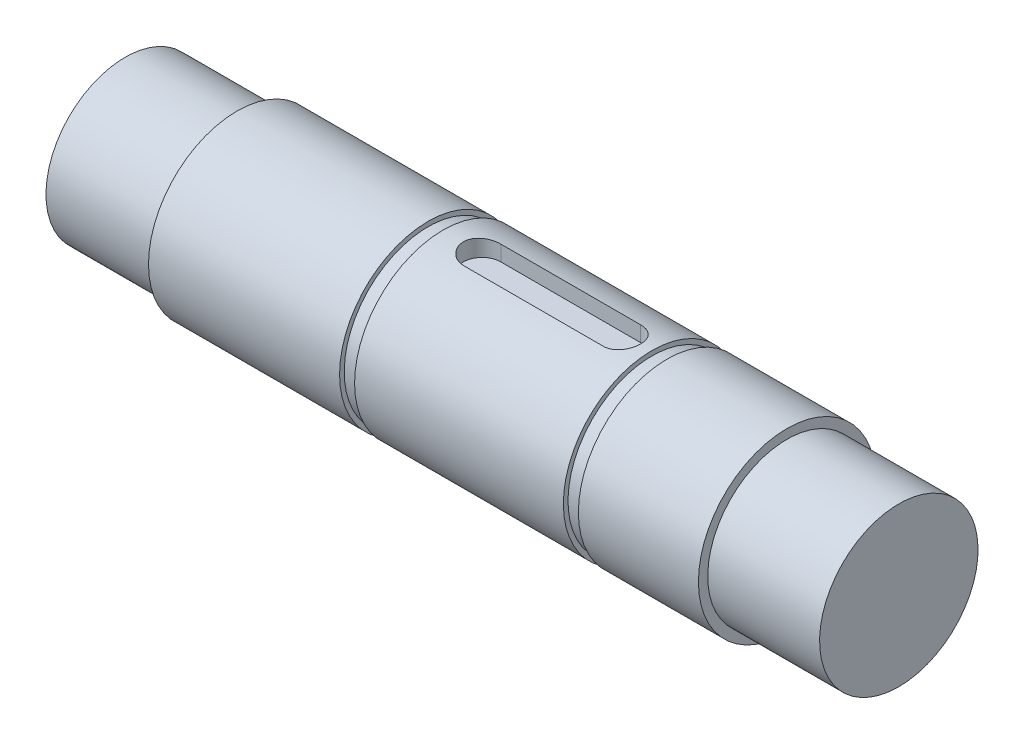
from build123d import *

# Parameters (mm, degrees)
SKETCH8_W          = 4
SKETCH8_H          = 1.9
CUT_EXTRUDE1_DEPTH = 7.5
CUT_EXTRUDE2_DEPTH = 10


with BuildPart() as part:
    # Sketch2 → Revolve2 (revolve)
    with BuildSketch(Plane.XY):
        Polygon((70.926736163, 9.411007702), (70.926736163, 0.911007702), (82.926736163, 0.911007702), (82.926736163, -0.088992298), (103.426736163, -0.088992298), (103.426736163, 0.411007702), (105.036736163, 0.411007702), (105.036736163, -0.088992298), (127.436736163, -0.088992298), (127.436736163, 0.411007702), (129.046736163, 0.411007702), (129.046736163, -0.088992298), (141.926736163, -0.088992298), (141.926736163, 0.911007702), (153.926736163, 0.911007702), (153.926736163, 9.411007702), align=None)
    revolve(axis=Axis((70.926736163, 9.411007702, 0), (1, 0, 0)))

    # Sketch8 → Cut-Extrude1 (cut, symmetric)
    with BuildSketch(Plane.ZY.offset(-116.720439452)):
        with Locations((0, 17.988403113)):
            Rectangle(SKETCH8_W, SKETCH8_H)
    extrude(amount=CUT_EXTRUDE1_DEPTH, both=True, mode=Mode.SUBTRACT)

    # Sketch9 → Cut-Extrude2 (cut)
    with BuildSketch(Plane(origin=(0, 17.038403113, 0), x_dir=(1, 0, 0), z_dir=(0, 1, 0))):
        with BuildLine():
            Line((109.220439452, 2), (124.220439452, 2))
            ThreePointArc((124.220439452, 2), (126.220439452, 0), (124.220439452, -2))
            Line((124.220439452, -2), (109.220439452, -2))
            ThreePointArc((109.220439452, -2), (107.220439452, 0), (109.220439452, 2))
        make_face()
    extrude(amount=CUT_EXTRUDE2_DEPTH, mode=Mode.SUBTRACT)


solid = part.part
